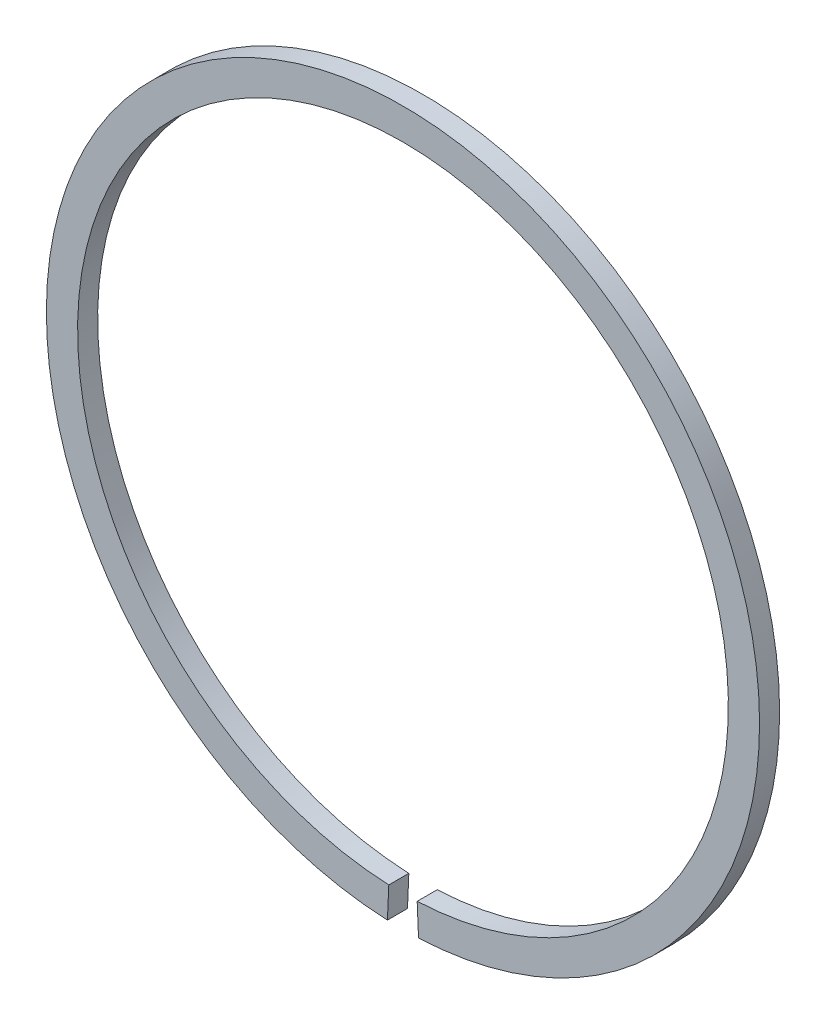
ISO-10303-21;
HEADER;
FILE_DESCRIPTION(('STEP AP214'),'2;1');
FILE_NAME('part.step','',(''),(''),'','','');
FILE_SCHEMA(('AUTOMOTIVE_DESIGN { 1 0 10303 214 1 1 1 1 }'));
ENDSEC;
DATA;
#1=APPLICATION_CONTEXT('core data for automotive mechanical design processes');
#2=APPLICATION_PROTOCOL_DEFINITION('international standard','automotive_design',2000,#1);
#3=PRODUCT_CONTEXT('',#1,'mechanical');
#4=PRODUCT('Part','Part','',(#3));
#5=PRODUCT_RELATED_PRODUCT_CATEGORY('part','',(#4));
#6=PRODUCT_DEFINITION_FORMATION('','',#4);
#7=PRODUCT_DEFINITION_CONTEXT('part definition',#1,'design');
#8=PRODUCT_DEFINITION('design','',#6,#7);
#9=PRODUCT_DEFINITION_SHAPE('','',#8);
#10=(LENGTH_UNIT() NAMED_UNIT(*) SI_UNIT(.MILLI.,.METRE.));
#11=(NAMED_UNIT(*) PLANE_ANGLE_UNIT() SI_UNIT($,.RADIAN.));
#12=(NAMED_UNIT(*) SI_UNIT($,.STERADIAN.) SOLID_ANGLE_UNIT());
#13=UNCERTAINTY_MEASURE_WITH_UNIT(LENGTH_MEASURE(1.E-05),#10,'distance_accuracy_value','');
#14=(GEOMETRIC_REPRESENTATION_CONTEXT(3) GLOBAL_UNCERTAINTY_ASSIGNED_CONTEXT((#13)) GLOBAL_UNIT_ASSIGNED_CONTEXT((#10,
#11,#12)) REPRESENTATION_CONTEXT('',''));
#15=CARTESIAN_POINT('',(0.,0.,0.));
#16=DIRECTION('',(0.,0.,1.));
#17=DIRECTION('',(1.,0.,0.));
#18=AXIS2_PLACEMENT_3D('',#15,#16,#17);
#19=CARTESIAN_POINT('',(0.,0.,0.9));
#20=DIRECTION('',(0.,0.,1.));
#21=DIRECTION('',(1.,0.,0.));
#22=AXIS2_PLACEMENT_3D('',#19,#20,#21);
#23=PLANE('',#22);
#24=CARTESIAN_POINT('',(0.,0.,0.9));
#25=DIRECTION('',(0.,0.,1.));
#26=DIRECTION('',(1.,0.,0.));
#27=AXIS2_PLACEMENT_3D('',#24,#25,#26);
#28=CIRCLE('',#27,16.);
#29=CARTESIAN_POINT('',(-0.69791019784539,-15.9847715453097,0.9));
#30=VERTEX_POINT('',#29);
#31=CARTESIAN_POINT('',(0.697910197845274,-15.9847715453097,0.9));
#32=VERTEX_POINT('',#31);
#33=EDGE_CURVE('E76',#30,#32,#28,.F.);
#34=ORIENTED_EDGE('',*,*,#33,.F.);
#35=DIRECTION('',(0.0436193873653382,0.999048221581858,0.));
#36=VECTOR('',#35,1.);
#37=CARTESIAN_POINT('',(-0.6979101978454,-15.98477154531,0.9));
#38=LINE('',#37,#36);
#39=CARTESIAN_POINT('',(-0.636843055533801,-14.5861040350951,0.9));
#40=VERTEX_POINT('',#39);
#41=EDGE_CURVE('E54',#40,#30,#38,.F.);
#42=ORIENTED_EDGE('',*,*,#41,.F.);
#43=CARTESIAN_POINT('',(0.,0.,0.9));
#44=DIRECTION('',(0.,0.,1.));
#45=DIRECTION('',(1.,0.,0.));
#46=AXIS2_PLACEMENT_3D('',#43,#44,#45);
#47=CIRCLE('',#46,14.6);
#48=CARTESIAN_POINT('',(0.636843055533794,-14.5861040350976,0.9));
#49=VERTEX_POINT('',#48);
#50=EDGE_CURVE('E20',#40,#49,#47,.F.);
#51=ORIENTED_EDGE('',*,*,#50,.T.);
#52=DIRECTION('',(0.0436193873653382,-0.999048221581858,0.));
#53=VECTOR('',#52,1.);
#54=CARTESIAN_POINT('',(0.6368430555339,-14.5861040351,0.9));
#55=LINE('',#54,#53);
#56=EDGE_CURVE('E59',#32,#49,#55,.F.);
#57=ORIENTED_EDGE('',*,*,#56,.F.);
#58=EDGE_LOOP('',(#34,#42,#51,#57));
#59=FACE_BOUND('',#58,.T.);
#60=ADVANCED_FACE('F16',(#59),#23,.T.);
#61=CARTESIAN_POINT('',(-0.6979101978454,-15.98477154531,0.));
#62=DIRECTION('',(0.999048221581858,-0.0436193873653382,0.));
#63=DIRECTION('',(0.0436193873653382,0.999048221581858,0.));
#64=AXIS2_PLACEMENT_3D('',#61,#62,#63);
#65=PLANE('',#64);
#66=DIRECTION('',(0.,0.,1.));
#67=VECTOR('',#66,1.);
#68=CARTESIAN_POINT('',(-0.697910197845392,-15.9847715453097,0.));
#69=LINE('',#68,#67);
#70=CARTESIAN_POINT('',(-0.69791019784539,-15.9847715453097,0.));
#71=VERTEX_POINT('',#70);
#72=EDGE_CURVE('E73',#71,#30,#69,.T.);
#73=ORIENTED_EDGE('',*,*,#72,.F.);
#74=DIRECTION('',(0.0436193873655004,0.99904822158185,0.));
#75=VECTOR('',#74,1.);
#76=CARTESIAN_POINT('',(-0.6979101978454,-15.98477154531,0.));
#77=LINE('',#76,#75);
#78=CARTESIAN_POINT('',(-0.636843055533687,-14.5861040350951,0.));
#79=VERTEX_POINT('',#78);
#80=EDGE_CURVE('E82',#71,#79,#77,.T.);
#81=ORIENTED_EDGE('',*,*,#80,.T.);
#82=DIRECTION('',(0.,0.,1.));
#83=VECTOR('',#82,1.);
#84=CARTESIAN_POINT('',(-0.636843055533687,-14.5861040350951,0.));
#85=LINE('',#84,#83);
#86=EDGE_CURVE('E68',#79,#40,#85,.T.);
#87=ORIENTED_EDGE('',*,*,#86,.T.);
#88=ORIENTED_EDGE('',*,*,#41,.T.);
#89=EDGE_LOOP('',(#73,#81,#87,#88));
#90=FACE_BOUND('',#89,.T.);
#91=ADVANCED_FACE('F90',(#90),#65,.T.);
#92=CARTESIAN_POINT('',(0.,0.,0.));
#93=DIRECTION('',(0.,0.,1.));
#94=DIRECTION('',(1.,0.,0.));
#95=AXIS2_PLACEMENT_3D('',#92,#93,#94);
#96=CYLINDRICAL_SURFACE('',#95,14.6);
#97=ORIENTED_EDGE('',*,*,#50,.F.);
#98=ORIENTED_EDGE('',*,*,#86,.F.);
#99=CARTESIAN_POINT('',(0.,0.,0.));
#100=DIRECTION('',(0.,0.,1.));
#101=DIRECTION('',(1.,0.,0.));
#102=AXIS2_PLACEMENT_3D('',#99,#100,#101);
#103=CIRCLE('',#102,14.6);
#104=CARTESIAN_POINT('',(0.636843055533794,-14.5861040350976,0.));
#105=VERTEX_POINT('',#104);
#106=EDGE_CURVE('E72',#79,#105,#103,.F.);
#107=ORIENTED_EDGE('',*,*,#106,.T.);
#108=DIRECTION('',(0.,0.,1.));
#109=VECTOR('',#108,1.);
#110=CARTESIAN_POINT('',(0.6368430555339,-14.5861040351,0.));
#111=LINE('',#110,#109);
#112=EDGE_CURVE('E63',#49,#105,#111,.F.);
#113=ORIENTED_EDGE('',*,*,#112,.F.);
#114=EDGE_LOOP('',(#97,#98,#107,#113));
#115=FACE_BOUND('',#114,.T.);
#116=ADVANCED_FACE('F70',(#115),#96,.F.);
#117=CARTESIAN_POINT('',(0.6368430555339,-14.5861040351,0.));
#118=DIRECTION('',(-0.999048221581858,-0.0436193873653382,0.));
#119=DIRECTION('',(0.0436193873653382,-0.999048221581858,0.));
#120=AXIS2_PLACEMENT_3D('',#117,#118,#119);
#121=PLANE('',#120);
#122=ORIENTED_EDGE('',*,*,#112,.T.);
#123=DIRECTION('',(0.0436193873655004,-0.99904822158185,0.));
#124=VECTOR('',#123,1.);
#125=CARTESIAN_POINT('',(0.6368430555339,-14.5861040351,0.));
#126=LINE('',#125,#124);
#127=CARTESIAN_POINT('',(0.697910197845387,-15.9847715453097,0.));
#128=VERTEX_POINT('',#127);
#129=EDGE_CURVE('E26',#105,#128,#126,.T.);
#130=ORIENTED_EDGE('',*,*,#129,.T.);
#131=DIRECTION('',(0.,0.,1.));
#132=VECTOR('',#131,1.);
#133=CARTESIAN_POINT('',(0.697910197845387,-15.9847715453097,0.));
#134=LINE('',#133,#132);
#135=EDGE_CURVE('E34',#32,#128,#134,.F.);
#136=ORIENTED_EDGE('',*,*,#135,.F.);
#137=ORIENTED_EDGE('',*,*,#56,.T.);
#138=EDGE_LOOP('',(#122,#130,#136,#137));
#139=FACE_BOUND('',#138,.T.);
#140=ADVANCED_FACE('F60',(#139),#121,.T.);
#141=CARTESIAN_POINT('',(0.,0.,0.));
#142=DIRECTION('',(0.,0.,1.));
#143=DIRECTION('',(1.,0.,0.));
#144=AXIS2_PLACEMENT_3D('',#141,#142,#143);
#145=CYLINDRICAL_SURFACE('',#144,16.);
#146=ORIENTED_EDGE('',*,*,#135,.T.);
#147=CARTESIAN_POINT('',(0.,0.,0.));
#148=DIRECTION('',(0.,0.,1.));
#149=DIRECTION('',(1.,0.,0.));
#150=AXIS2_PLACEMENT_3D('',#147,#148,#149);
#151=CIRCLE('',#150,16.);
#152=EDGE_CURVE('E11',#128,#71,#151,.T.);
#153=ORIENTED_EDGE('',*,*,#152,.T.);
#154=ORIENTED_EDGE('',*,*,#72,.T.);
#155=ORIENTED_EDGE('',*,*,#33,.T.);
#156=EDGE_LOOP('',(#146,#153,#154,#155));
#157=FACE_BOUND('',#156,.T.);
#158=ADVANCED_FACE('F88',(#157),#145,.T.);
#159=CARTESIAN_POINT('',(0.,0.,0.));
#160=DIRECTION('',(0.,0.,1.));
#161=DIRECTION('',(1.,0.,0.));
#162=AXIS2_PLACEMENT_3D('',#159,#160,#161);
#163=PLANE('',#162);
#164=ORIENTED_EDGE('',*,*,#129,.F.);
#165=ORIENTED_EDGE('',*,*,#106,.F.);
#166=ORIENTED_EDGE('',*,*,#80,.F.);
#167=ORIENTED_EDGE('',*,*,#152,.F.);
#168=EDGE_LOOP('',(#164,#165,#166,#167));
#169=FACE_BOUND('',#168,.T.);
#170=ADVANCED_FACE('F18',(#169),#163,.F.);
#171=CLOSED_SHELL('',(#60,#91,#116,#140,#158,#170));
#172=MANIFOLD_SOLID_BREP('B1',#171);
#173=ADVANCED_BREP_SHAPE_REPRESENTATION('',(#18,#172),#14);
#174=SHAPE_DEFINITION_REPRESENTATION(#9,#173);
ENDSEC;
END-ISO-10303-21;
